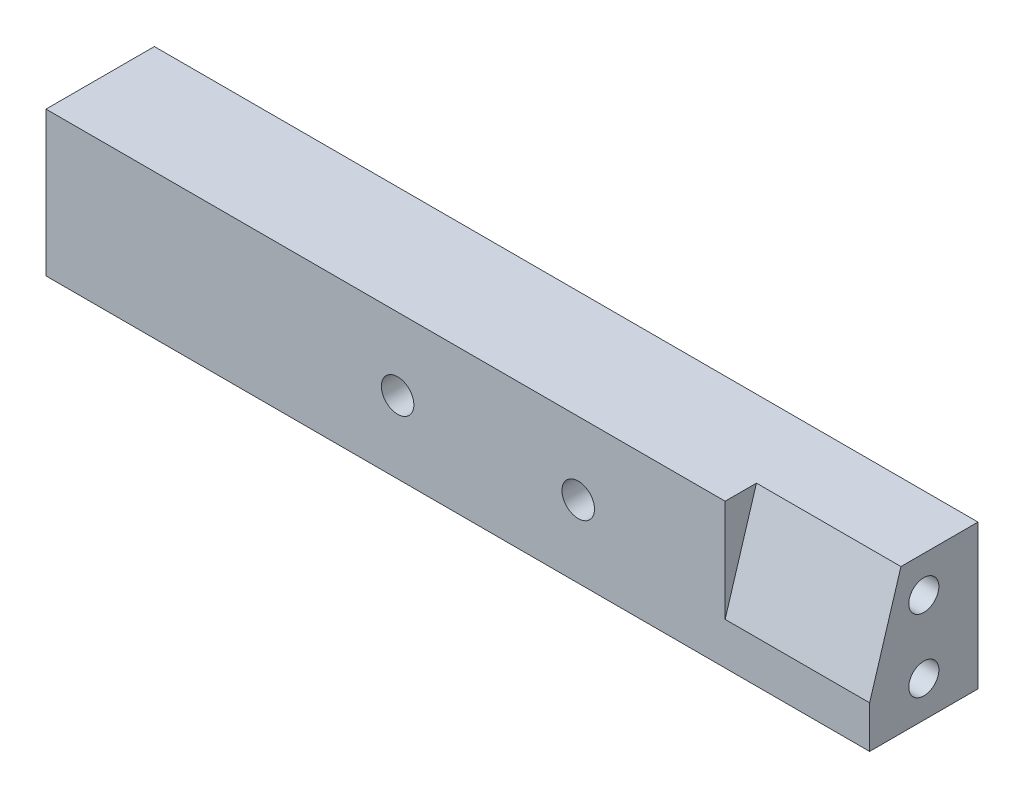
ISO-10303-21;
HEADER;
FILE_DESCRIPTION(('STEP AP214'),'2;1');
FILE_NAME('part.step','',(''),(''),'','','');
FILE_SCHEMA(('AUTOMOTIVE_DESIGN { 1 0 10303 214 1 1 1 1 }'));
ENDSEC;
DATA;
#1=APPLICATION_CONTEXT('core data for automotive mechanical design processes');
#2=APPLICATION_PROTOCOL_DEFINITION('international standard','automotive_design',2000,#1);
#3=PRODUCT_CONTEXT('',#1,'mechanical');
#4=PRODUCT('Part','Part','',(#3));
#5=PRODUCT_RELATED_PRODUCT_CATEGORY('part','',(#4));
#6=PRODUCT_DEFINITION_FORMATION('','',#4);
#7=PRODUCT_DEFINITION_CONTEXT('part definition',#1,'design');
#8=PRODUCT_DEFINITION('design','',#6,#7);
#9=PRODUCT_DEFINITION_SHAPE('','',#8);
#10=(LENGTH_UNIT() NAMED_UNIT(*) SI_UNIT(.MILLI.,.METRE.));
#11=(NAMED_UNIT(*) PLANE_ANGLE_UNIT() SI_UNIT($,.RADIAN.));
#12=(NAMED_UNIT(*) SI_UNIT($,.STERADIAN.) SOLID_ANGLE_UNIT());
#13=UNCERTAINTY_MEASURE_WITH_UNIT(LENGTH_MEASURE(1.E-05),#10,'distance_accuracy_value','');
#14=(GEOMETRIC_REPRESENTATION_CONTEXT(3) GLOBAL_UNCERTAINTY_ASSIGNED_CONTEXT((#13)) GLOBAL_UNIT_ASSIGNED_CONTEXT((#10,
#11,#12)) REPRESENTATION_CONTEXT('',''));
#15=CARTESIAN_POINT('',(0.,0.,0.));
#16=DIRECTION('',(0.,0.,1.));
#17=DIRECTION('',(1.,0.,0.));
#18=AXIS2_PLACEMENT_3D('',#15,#16,#17);
#19=CARTESIAN_POINT('',(34.2,6.,4.5));
#20=DIRECTION('',(0.,-1.,0.));
#21=DIRECTION('',(0.,0.,-1.));
#22=AXIS2_PLACEMENT_3D('',#19,#20,#21);
#23=PLANE('',#22);
#24=DIRECTION('',(1.,0.,0.));
#25=VECTOR('',#24,1.);
#26=CARTESIAN_POINT('',(22.2,6.,1.9));
#27=LINE('',#26,#25);
#28=CARTESIAN_POINT('',(22.2,6.,1.9));
#29=VERTEX_POINT('',#28);
#30=CARTESIAN_POINT('',(34.2,6.,1.9));
#31=VERTEX_POINT('',#30);
#32=EDGE_CURVE('E110',#29,#31,#27,.T.);
#33=ORIENTED_EDGE('',*,*,#32,.T.);
#34=DIRECTION('',(0.,0.,1.));
#35=VECTOR('',#34,1.);
#36=CARTESIAN_POINT('',(34.2,6.,-3.02658526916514));
#37=LINE('',#36,#35);
#38=CARTESIAN_POINT('',(34.2,6.,-4.5));
#39=VERTEX_POINT('',#38);
#40=EDGE_CURVE('E88',#39,#31,#37,.T.);
#41=ORIENTED_EDGE('',*,*,#40,.F.);
#42=DIRECTION('',(-1.,0.,0.));
#43=VECTOR('',#42,1.);
#44=CARTESIAN_POINT('',(34.2,6.,-4.5));
#45=LINE('',#44,#43);
#46=CARTESIAN_POINT('',(-34.2,6.,-4.5));
#47=VERTEX_POINT('',#46);
#48=EDGE_CURVE('E11',#39,#47,#45,.T.);
#49=ORIENTED_EDGE('',*,*,#48,.T.);
#50=DIRECTION('',(0.,0.,1.));
#51=VECTOR('',#50,1.);
#52=CARTESIAN_POINT('',(-34.2,6.,4.5));
#53=LINE('',#52,#51);
#54=CARTESIAN_POINT('',(-34.2,6.,4.5));
#55=VERTEX_POINT('',#54);
#56=EDGE_CURVE('E177',#47,#55,#53,.T.);
#57=ORIENTED_EDGE('',*,*,#56,.T.);
#58=DIRECTION('',(-1.,0.,0.));
#59=VECTOR('',#58,1.);
#60=CARTESIAN_POINT('',(34.2,6.,4.5));
#61=LINE('',#60,#59);
#62=CARTESIAN_POINT('',(22.2,6.,4.5));
#63=VERTEX_POINT('',#62);
#64=EDGE_CURVE('E46',#63,#55,#61,.T.);
#65=ORIENTED_EDGE('',*,*,#64,.F.);
#66=DIRECTION('',(0.,0.,1.));
#67=VECTOR('',#66,1.);
#68=CARTESIAN_POINT('',(22.2,6.,0.));
#69=LINE('',#68,#67);
#70=EDGE_CURVE('E121',#29,#63,#69,.T.);
#71=ORIENTED_EDGE('',*,*,#70,.F.);
#72=EDGE_LOOP('',(#33,#41,#49,#57,#65,#71));
#73=FACE_BOUND('',#72,.T.);
#74=ADVANCED_FACE('F38',(#73),#23,.F.);
#75=CARTESIAN_POINT('',(34.2,-6.,4.5));
#76=DIRECTION('',(0.,0.,-1.));
#77=DIRECTION('',(-1.,0.,0.));
#78=AXIS2_PLACEMENT_3D('',#75,#76,#77);
#79=PLANE('',#78);
#80=CARTESIAN_POINT('',(-5.,0.,4.5));
#81=DIRECTION('',(0.,0.,-1.));
#82=DIRECTION('',(-1.,0.,0.));
#83=AXIS2_PLACEMENT_3D('',#80,#81,#82);
#84=CIRCLE('',#83,1.35);
#85=CARTESIAN_POINT('',(-6.35,0.,4.5));
#86=VERTEX_POINT('',#85);
#87=EDGE_CURVE('E139',#86,#86,#84,.T.);
#88=ORIENTED_EDGE('',*,*,#87,.T.);
#89=EDGE_LOOP('',(#88));
#90=FACE_BOUND('',#89,.T.);
#91=CARTESIAN_POINT('',(10.,0.,4.5));
#92=DIRECTION('',(0.,0.,-1.));
#93=DIRECTION('',(-1.,0.,0.));
#94=AXIS2_PLACEMENT_3D('',#91,#92,#93);
#95=CIRCLE('',#94,1.35);
#96=CARTESIAN_POINT('',(8.65,0.,4.5));
#97=VERTEX_POINT('',#96);
#98=EDGE_CURVE('E132',#97,#97,#95,.T.);
#99=ORIENTED_EDGE('',*,*,#98,.T.);
#100=EDGE_LOOP('',(#99));
#101=FACE_BOUND('',#100,.T.);
#102=DIRECTION('',(1.,0.,0.));
#103=VECTOR('',#102,1.);
#104=CARTESIAN_POINT('',(22.2,-2.5,4.5));
#105=LINE('',#104,#103);
#106=CARTESIAN_POINT('',(22.2,-2.5,4.5));
#107=VERTEX_POINT('',#106);
#108=CARTESIAN_POINT('',(34.2,-2.5,4.5));
#109=VERTEX_POINT('',#108);
#110=EDGE_CURVE('E53',#107,#109,#105,.T.);
#111=ORIENTED_EDGE('',*,*,#110,.F.);
#112=DIRECTION('',(0.,-1.,0.));
#113=VECTOR('',#112,1.);
#114=CARTESIAN_POINT('',(22.2,0.,4.5));
#115=LINE('',#114,#113);
#116=EDGE_CURVE('E117',#63,#107,#115,.T.);
#117=ORIENTED_EDGE('',*,*,#116,.F.);
#118=ORIENTED_EDGE('',*,*,#64,.T.);
#119=DIRECTION('',(0.,-1.,0.));
#120=VECTOR('',#119,1.);
#121=CARTESIAN_POINT('',(-34.2,-6.,4.5));
#122=LINE('',#121,#120);
#123=CARTESIAN_POINT('',(-34.2,-6.,4.5));
#124=VERTEX_POINT('',#123);
#125=EDGE_CURVE('E179',#55,#124,#122,.T.);
#126=ORIENTED_EDGE('',*,*,#125,.T.);
#127=DIRECTION('',(-1.,0.,0.));
#128=VECTOR('',#127,1.);
#129=CARTESIAN_POINT('',(34.2,-6.,4.5));
#130=LINE('',#129,#128);
#131=CARTESIAN_POINT('',(34.2,-6.,4.5));
#132=VERTEX_POINT('',#131);
#133=EDGE_CURVE('E183',#132,#124,#130,.T.);
#134=ORIENTED_EDGE('',*,*,#133,.F.);
#135=DIRECTION('',(0.,-1.,0.));
#136=VECTOR('',#135,1.);
#137=CARTESIAN_POINT('',(34.2,-6.,4.5));
#138=LINE('',#137,#136);
#139=EDGE_CURVE('E171',#109,#132,#138,.T.);
#140=ORIENTED_EDGE('',*,*,#139,.F.);
#141=EDGE_LOOP('',(#111,#117,#118,#126,#134,#140));
#142=FACE_BOUND('',#141,.T.);
#143=ADVANCED_FACE('F185',(#90,#101,#142),#79,.F.);
#144=CARTESIAN_POINT('',(34.2,0.,0.));
#145=DIRECTION('',(1.,0.,0.));
#146=DIRECTION('',(0.,0.,-1.));
#147=AXIS2_PLACEMENT_3D('',#144,#145,#146);
#148=PLANE('',#147);
#149=CARTESIAN_POINT('',(34.2,-3.,0.));
#150=DIRECTION('',(1.,0.,0.));
#151=DIRECTION('',(0.,0.,-1.));
#152=AXIS2_PLACEMENT_3D('',#149,#150,#151);
#153=CIRCLE('',#152,1.24999999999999);
#154=CARTESIAN_POINT('',(34.2,-3.,-1.24999999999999));
#155=VERTEX_POINT('',#154);
#156=EDGE_CURVE('E155',#155,#155,#153,.T.);
#157=ORIENTED_EDGE('',*,*,#156,.F.);
#158=EDGE_LOOP('',(#157));
#159=FACE_BOUND('',#158,.T.);
#160=CARTESIAN_POINT('',(34.2,3.,0.));
#161=DIRECTION('',(1.,0.,0.));
#162=DIRECTION('',(0.,0.,-1.));
#163=AXIS2_PLACEMENT_3D('',#160,#161,#162);
#164=CIRCLE('',#163,1.24999999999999);
#165=CARTESIAN_POINT('',(34.2,3.,-1.24999999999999));
#166=VERTEX_POINT('',#165);
#167=EDGE_CURVE('E161',#166,#166,#164,.T.);
#168=ORIENTED_EDGE('',*,*,#167,.F.);
#169=EDGE_LOOP('',(#168));
#170=FACE_BOUND('',#169,.T.);
#171=ORIENTED_EDGE('',*,*,#40,.T.);
#172=DIRECTION('',(0.,-0.956264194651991,0.29250434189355));
#173=VECTOR('',#172,1.);
#174=CARTESIAN_POINT('',(34.2,1.04480445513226,3.41570687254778));
#175=LINE('',#174,#173);
#176=EDGE_CURVE('E115',#31,#109,#175,.T.);
#177=ORIENTED_EDGE('',*,*,#176,.T.);
#178=ORIENTED_EDGE('',*,*,#139,.T.);
#179=DIRECTION('',(0.,0.,-1.));
#180=VECTOR('',#179,1.);
#181=CARTESIAN_POINT('',(34.2,-6.,4.5));
#182=LINE('',#181,#180);
#183=CARTESIAN_POINT('',(34.2,-6.,-4.5));
#184=VERTEX_POINT('',#183);
#185=EDGE_CURVE('E62',#132,#184,#182,.T.);
#186=ORIENTED_EDGE('',*,*,#185,.T.);
#187=DIRECTION('',(0.,1.,0.));
#188=VECTOR('',#187,1.);
#189=CARTESIAN_POINT('',(34.2,6.,-4.5));
#190=LINE('',#189,#188);
#191=EDGE_CURVE('E168',#184,#39,#190,.T.);
#192=ORIENTED_EDGE('',*,*,#191,.T.);
#193=EDGE_LOOP('',(#171,#177,#178,#186,#192));
#194=FACE_BOUND('',#193,.T.);
#195=ADVANCED_FACE('F196',(#159,#170,#194),#148,.T.);
#196=CARTESIAN_POINT('',(34.2,6.,-4.5));
#197=DIRECTION('',(0.,0.,1.));
#198=DIRECTION('',(1.,0.,0.));
#199=AXIS2_PLACEMENT_3D('',#196,#197,#198);
#200=PLANE('',#199);
#201=CARTESIAN_POINT('',(10.,0.,-4.5));
#202=DIRECTION('',(0.,0.,-1.));
#203=DIRECTION('',(-1.,0.,0.));
#204=AXIS2_PLACEMENT_3D('',#201,#202,#203);
#205=CIRCLE('',#204,1.35);
#206=CARTESIAN_POINT('',(8.65,0.,-4.5));
#207=VERTEX_POINT('',#206);
#208=EDGE_CURVE('E136',#207,#207,#205,.T.);
#209=ORIENTED_EDGE('',*,*,#208,.F.);
#210=EDGE_LOOP('',(#209));
#211=FACE_BOUND('',#210,.T.);
#212=CARTESIAN_POINT('',(-5.,0.,-4.5));
#213=DIRECTION('',(0.,0.,-1.));
#214=DIRECTION('',(-1.,0.,0.));
#215=AXIS2_PLACEMENT_3D('',#212,#213,#214);
#216=CIRCLE('',#215,1.35);
#217=CARTESIAN_POINT('',(-6.35,0.,-4.5));
#218=VERTEX_POINT('',#217);
#219=EDGE_CURVE('E130',#218,#218,#216,.T.);
#220=ORIENTED_EDGE('',*,*,#219,.F.);
#221=EDGE_LOOP('',(#220));
#222=FACE_BOUND('',#221,.T.);
#223=DIRECTION('',(0.,1.,0.));
#224=VECTOR('',#223,1.);
#225=CARTESIAN_POINT('',(-34.2,6.,-4.5));
#226=LINE('',#225,#224);
#227=CARTESIAN_POINT('',(-34.2,-6.,-4.5));
#228=VERTEX_POINT('',#227);
#229=EDGE_CURVE('E167',#228,#47,#226,.T.);
#230=ORIENTED_EDGE('',*,*,#229,.T.);
#231=ORIENTED_EDGE('',*,*,#48,.F.);
#232=ORIENTED_EDGE('',*,*,#191,.F.);
#233=DIRECTION('',(-1.,0.,0.));
#234=VECTOR('',#233,1.);
#235=CARTESIAN_POINT('',(34.2,-6.,-4.5));
#236=LINE('',#235,#234);
#237=EDGE_CURVE('E174',#184,#228,#236,.T.);
#238=ORIENTED_EDGE('',*,*,#237,.T.);
#239=EDGE_LOOP('',(#230,#231,#232,#238));
#240=FACE_BOUND('',#239,.T.);
#241=ADVANCED_FACE('F40',(#211,#222,#240),#200,.F.);
#242=CARTESIAN_POINT('',(34.2,-6.,4.5));
#243=DIRECTION('',(0.,1.,0.));
#244=DIRECTION('',(0.,0.,1.));
#245=AXIS2_PLACEMENT_3D('',#242,#243,#244);
#246=PLANE('',#245);
#247=DIRECTION('',(0.,0.,-1.));
#248=VECTOR('',#247,1.);
#249=CARTESIAN_POINT('',(-34.2,-6.,4.5));
#250=LINE('',#249,#248);
#251=EDGE_CURVE('E82',#124,#228,#250,.T.);
#252=ORIENTED_EDGE('',*,*,#251,.T.);
#253=ORIENTED_EDGE('',*,*,#237,.F.);
#254=ORIENTED_EDGE('',*,*,#185,.F.);
#255=ORIENTED_EDGE('',*,*,#133,.T.);
#256=EDGE_LOOP('',(#252,#253,#254,#255));
#257=FACE_BOUND('',#256,.T.);
#258=ADVANCED_FACE('F194',(#257),#246,.F.);
#259=CARTESIAN_POINT('',(-34.2,0.,0.));
#260=DIRECTION('',(1.,0.,0.));
#261=DIRECTION('',(0.,0.,-1.));
#262=AXIS2_PLACEMENT_3D('',#259,#260,#261);
#263=PLANE('',#262);
#264=CARTESIAN_POINT('',(-34.2,3.,0.));
#265=DIRECTION('',(-1.,0.,0.));
#266=DIRECTION('',(0.,0.,1.));
#267=AXIS2_PLACEMENT_3D('',#264,#265,#266);
#268=CIRCLE('',#267,1.24999999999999);
#269=CARTESIAN_POINT('',(-34.2,3.,1.24999999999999));
#270=VERTEX_POINT('',#269);
#271=EDGE_CURVE('E135',#270,#270,#268,.T.);
#272=ORIENTED_EDGE('',*,*,#271,.F.);
#273=EDGE_LOOP('',(#272));
#274=FACE_BOUND('',#273,.T.);
#275=CARTESIAN_POINT('',(-34.2,-3.,0.));
#276=DIRECTION('',(-1.,0.,0.));
#277=DIRECTION('',(0.,0.,1.));
#278=AXIS2_PLACEMENT_3D('',#275,#276,#277);
#279=CIRCLE('',#278,1.24999999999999);
#280=CARTESIAN_POINT('',(-34.2,-3.,1.24999999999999));
#281=VERTEX_POINT('',#280);
#282=EDGE_CURVE('E149',#281,#281,#279,.T.);
#283=ORIENTED_EDGE('',*,*,#282,.F.);
#284=EDGE_LOOP('',(#283));
#285=FACE_BOUND('',#284,.T.);
#286=ORIENTED_EDGE('',*,*,#229,.F.);
#287=ORIENTED_EDGE('',*,*,#251,.F.);
#288=ORIENTED_EDGE('',*,*,#125,.F.);
#289=ORIENTED_EDGE('',*,*,#56,.F.);
#290=EDGE_LOOP('',(#286,#287,#288,#289));
#291=FACE_BOUND('',#290,.T.);
#292=ADVANCED_FACE('F191',(#274,#285,#291),#263,.F.);
#293=CARTESIAN_POINT('',(25.7,3.,0.));
#294=DIRECTION('',(1.,0.,0.));
#295=DIRECTION('',(0.,0.,-1.));
#296=AXIS2_PLACEMENT_3D('',#293,#294,#295);
#297=CONICAL_SURFACE('',#296,1.25,1.02974425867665);
#298=CARTESIAN_POINT('',(24.9489242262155,3.,0.));
#299=VERTEX_POINT('',#298);
#300=VERTEX_LOOP('',#299);
#301=FACE_BOUND('',#300,.T.);
#302=CARTESIAN_POINT('',(25.7,3.,0.));
#303=DIRECTION('',(1.,0.,0.));
#304=DIRECTION('',(0.,0.,-1.));
#305=AXIS2_PLACEMENT_3D('',#302,#303,#304);
#306=CIRCLE('',#305,1.25);
#307=CARTESIAN_POINT('',(25.7,3.,-1.25));
#308=VERTEX_POINT('',#307);
#309=EDGE_CURVE('E164',#308,#308,#306,.T.);
#310=ORIENTED_EDGE('',*,*,#309,.T.);
#311=EDGE_LOOP('',(#310));
#312=FACE_BOUND('',#311,.T.);
#313=ADVANCED_FACE('F217',(#301,#312),#297,.F.);
#314=CARTESIAN_POINT('',(34.2,3.,0.));
#315=DIRECTION('',(1.,0.,0.));
#316=DIRECTION('',(0.,0.,-1.));
#317=AXIS2_PLACEMENT_3D('',#314,#315,#316);
#318=CYLINDRICAL_SURFACE('',#317,1.24999999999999);
#319=ORIENTED_EDGE('',*,*,#309,.F.);
#320=EDGE_LOOP('',(#319));
#321=FACE_BOUND('',#320,.T.);
#322=ORIENTED_EDGE('',*,*,#167,.T.);
#323=EDGE_LOOP('',(#322));
#324=FACE_BOUND('',#323,.T.);
#325=ADVANCED_FACE('F222',(#321,#324),#318,.F.);
#326=CARTESIAN_POINT('',(25.7,-3.,0.));
#327=DIRECTION('',(1.,0.,0.));
#328=DIRECTION('',(0.,0.,-1.));
#329=AXIS2_PLACEMENT_3D('',#326,#327,#328);
#330=CONICAL_SURFACE('',#329,1.25,1.02974425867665);
#331=CARTESIAN_POINT('',(24.9489242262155,-3.,0.));
#332=VERTEX_POINT('',#331);
#333=VERTEX_LOOP('',#332);
#334=FACE_BOUND('',#333,.T.);
#335=CARTESIAN_POINT('',(25.7,-3.,0.));
#336=DIRECTION('',(1.,0.,0.));
#337=DIRECTION('',(0.,0.,-1.));
#338=AXIS2_PLACEMENT_3D('',#335,#336,#337);
#339=CIRCLE('',#338,1.25);
#340=CARTESIAN_POINT('',(25.7,-3.,-1.25));
#341=VERTEX_POINT('',#340);
#342=EDGE_CURVE('E158',#341,#341,#339,.T.);
#343=ORIENTED_EDGE('',*,*,#342,.T.);
#344=EDGE_LOOP('',(#343));
#345=FACE_BOUND('',#344,.T.);
#346=ADVANCED_FACE('F249',(#334,#345),#330,.F.);
#347=CARTESIAN_POINT('',(34.2,-3.,0.));
#348=DIRECTION('',(1.,0.,0.));
#349=DIRECTION('',(0.,0.,-1.));
#350=AXIS2_PLACEMENT_3D('',#347,#348,#349);
#351=CYLINDRICAL_SURFACE('',#350,1.24999999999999);
#352=ORIENTED_EDGE('',*,*,#342,.F.);
#353=EDGE_LOOP('',(#352));
#354=FACE_BOUND('',#353,.T.);
#355=ORIENTED_EDGE('',*,*,#156,.T.);
#356=EDGE_LOOP('',(#355));
#357=FACE_BOUND('',#356,.T.);
#358=ADVANCED_FACE('F241',(#354,#357),#351,.F.);
#359=CARTESIAN_POINT('',(-25.7,-3.,0.));
#360=DIRECTION('',(-1.,0.,0.));
#361=DIRECTION('',(0.,0.,1.));
#362=AXIS2_PLACEMENT_3D('',#359,#360,#361);
#363=CONICAL_SURFACE('',#362,1.24999999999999,1.02974425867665);
#364=CARTESIAN_POINT('',(-24.9489242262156,-3.,0.));
#365=VERTEX_POINT('',#364);
#366=VERTEX_LOOP('',#365);
#367=FACE_BOUND('',#366,.T.);
#368=CARTESIAN_POINT('',(-25.7,-3.,0.));
#369=DIRECTION('',(-1.,0.,0.));
#370=DIRECTION('',(0.,0.,1.));
#371=AXIS2_PLACEMENT_3D('',#368,#369,#370);
#372=CIRCLE('',#371,1.24999999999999);
#373=CARTESIAN_POINT('',(-25.7,-3.,1.24999999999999));
#374=VERTEX_POINT('',#373);
#375=EDGE_CURVE('E152',#374,#374,#372,.T.);
#376=ORIENTED_EDGE('',*,*,#375,.T.);
#377=EDGE_LOOP('',(#376));
#378=FACE_BOUND('',#377,.T.);
#379=ADVANCED_FACE('F231',(#367,#378),#363,.F.);
#380=CARTESIAN_POINT('',(-34.2,-3.,0.));
#381=DIRECTION('',(-1.,0.,0.));
#382=DIRECTION('',(0.,0.,1.));
#383=AXIS2_PLACEMENT_3D('',#380,#381,#382);
#384=CYLINDRICAL_SURFACE('',#383,1.24999999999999);
#385=ORIENTED_EDGE('',*,*,#375,.F.);
#386=EDGE_LOOP('',(#385));
#387=FACE_BOUND('',#386,.T.);
#388=ORIENTED_EDGE('',*,*,#282,.T.);
#389=EDGE_LOOP('',(#388));
#390=FACE_BOUND('',#389,.T.);
#391=ADVANCED_FACE('F228',(#387,#390),#384,.F.);
#392=CARTESIAN_POINT('',(-25.7,3.,0.));
#393=DIRECTION('',(-1.,0.,0.));
#394=DIRECTION('',(0.,0.,1.));
#395=AXIS2_PLACEMENT_3D('',#392,#393,#394);
#396=CONICAL_SURFACE('',#395,1.24999999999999,1.02974425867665);
#397=CARTESIAN_POINT('',(-24.9489242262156,3.,0.));
#398=VERTEX_POINT('',#397);
#399=VERTEX_LOOP('',#398);
#400=FACE_BOUND('',#399,.T.);
#401=CARTESIAN_POINT('',(-25.7,3.,0.));
#402=DIRECTION('',(-1.,0.,0.));
#403=DIRECTION('',(0.,0.,1.));
#404=AXIS2_PLACEMENT_3D('',#401,#402,#403);
#405=CIRCLE('',#404,1.24999999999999);
#406=CARTESIAN_POINT('',(-25.7,3.,1.24999999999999));
#407=VERTEX_POINT('',#406);
#408=EDGE_CURVE('E146',#407,#407,#405,.T.);
#409=ORIENTED_EDGE('',*,*,#408,.T.);
#410=EDGE_LOOP('',(#409));
#411=FACE_BOUND('',#410,.T.);
#412=ADVANCED_FACE('F230',(#400,#411),#396,.F.);
#413=CARTESIAN_POINT('',(-34.2,3.,0.));
#414=DIRECTION('',(-1.,0.,0.));
#415=DIRECTION('',(0.,0.,1.));
#416=AXIS2_PLACEMENT_3D('',#413,#414,#415);
#417=CYLINDRICAL_SURFACE('',#416,1.24999999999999);
#418=ORIENTED_EDGE('',*,*,#408,.F.);
#419=EDGE_LOOP('',(#418));
#420=FACE_BOUND('',#419,.T.);
#421=ORIENTED_EDGE('',*,*,#271,.T.);
#422=EDGE_LOOP('',(#421));
#423=FACE_BOUND('',#422,.T.);
#424=ADVANCED_FACE('F238',(#420,#423),#417,.F.);
#425=CARTESIAN_POINT('',(-5.,0.,4.5));
#426=DIRECTION('',(0.,0.,-1.));
#427=DIRECTION('',(-1.,0.,0.));
#428=AXIS2_PLACEMENT_3D('',#425,#426,#427);
#429=CYLINDRICAL_SURFACE('',#428,1.35);
#430=ORIENTED_EDGE('',*,*,#87,.F.);
#431=EDGE_LOOP('',(#430));
#432=FACE_BOUND('',#431,.T.);
#433=ORIENTED_EDGE('',*,*,#219,.T.);
#434=EDGE_LOOP('',(#433));
#435=FACE_BOUND('',#434,.T.);
#436=ADVANCED_FACE('F304',(#432,#435),#429,.F.);
#437=CARTESIAN_POINT('',(10.,0.,4.5));
#438=DIRECTION('',(0.,0.,-1.));
#439=DIRECTION('',(-1.,0.,0.));
#440=AXIS2_PLACEMENT_3D('',#437,#438,#439);
#441=CYLINDRICAL_SURFACE('',#440,1.35);
#442=ORIENTED_EDGE('',*,*,#98,.F.);
#443=EDGE_LOOP('',(#442));
#444=FACE_BOUND('',#443,.T.);
#445=ORIENTED_EDGE('',*,*,#208,.T.);
#446=EDGE_LOOP('',(#445));
#447=FACE_BOUND('',#446,.T.);
#448=ADVANCED_FACE('F321',(#444,#447),#441,.F.);
#449=CARTESIAN_POINT('',(22.2,1.04480445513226,3.41570687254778));
#450=DIRECTION('',(0.,0.29250434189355,0.956264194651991));
#451=DIRECTION('',(0.,-0.956264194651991,0.29250434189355));
#452=AXIS2_PLACEMENT_3D('',#449,#450,#451);
#453=PLANE('',#452);
#454=ORIENTED_EDGE('',*,*,#176,.F.);
#455=ORIENTED_EDGE('',*,*,#32,.F.);
#456=DIRECTION('',(0.,-0.956264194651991,0.29250434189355));
#457=VECTOR('',#456,1.);
#458=CARTESIAN_POINT('',(22.2,1.04480445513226,3.41570687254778));
#459=LINE('',#458,#457);
#460=EDGE_CURVE('E113',#29,#107,#459,.T.);
#461=ORIENTED_EDGE('',*,*,#460,.T.);
#462=ORIENTED_EDGE('',*,*,#110,.T.);
#463=EDGE_LOOP('',(#454,#455,#461,#462));
#464=FACE_BOUND('',#463,.T.);
#465=ADVANCED_FACE('F112',(#464),#453,.T.);
#466=CARTESIAN_POINT('',(22.2,0.,0.));
#467=DIRECTION('',(1.,0.,0.));
#468=DIRECTION('',(0.,0.,-1.));
#469=AXIS2_PLACEMENT_3D('',#466,#467,#468);
#470=PLANE('',#469);
#471=ORIENTED_EDGE('',*,*,#460,.F.);
#472=ORIENTED_EDGE('',*,*,#70,.T.);
#473=ORIENTED_EDGE('',*,*,#116,.T.);
#474=EDGE_LOOP('',(#471,#472,#473));
#475=FACE_BOUND('',#474,.T.);
#476=ADVANCED_FACE('F120',(#475),#470,.T.);
#477=CLOSED_SHELL('',(#74,#143,#195,#241,#258,#292,#313,#325,#346,#358,#379,#391,#412,#424,#436,
#448,#465,#476));
#478=MANIFOLD_SOLID_BREP('B2',#477);
#479=ADVANCED_BREP_SHAPE_REPRESENTATION('',(#18,#478),#14);
#480=SHAPE_DEFINITION_REPRESENTATION(#9,#479);
ENDSEC;
END-ISO-10303-21;
